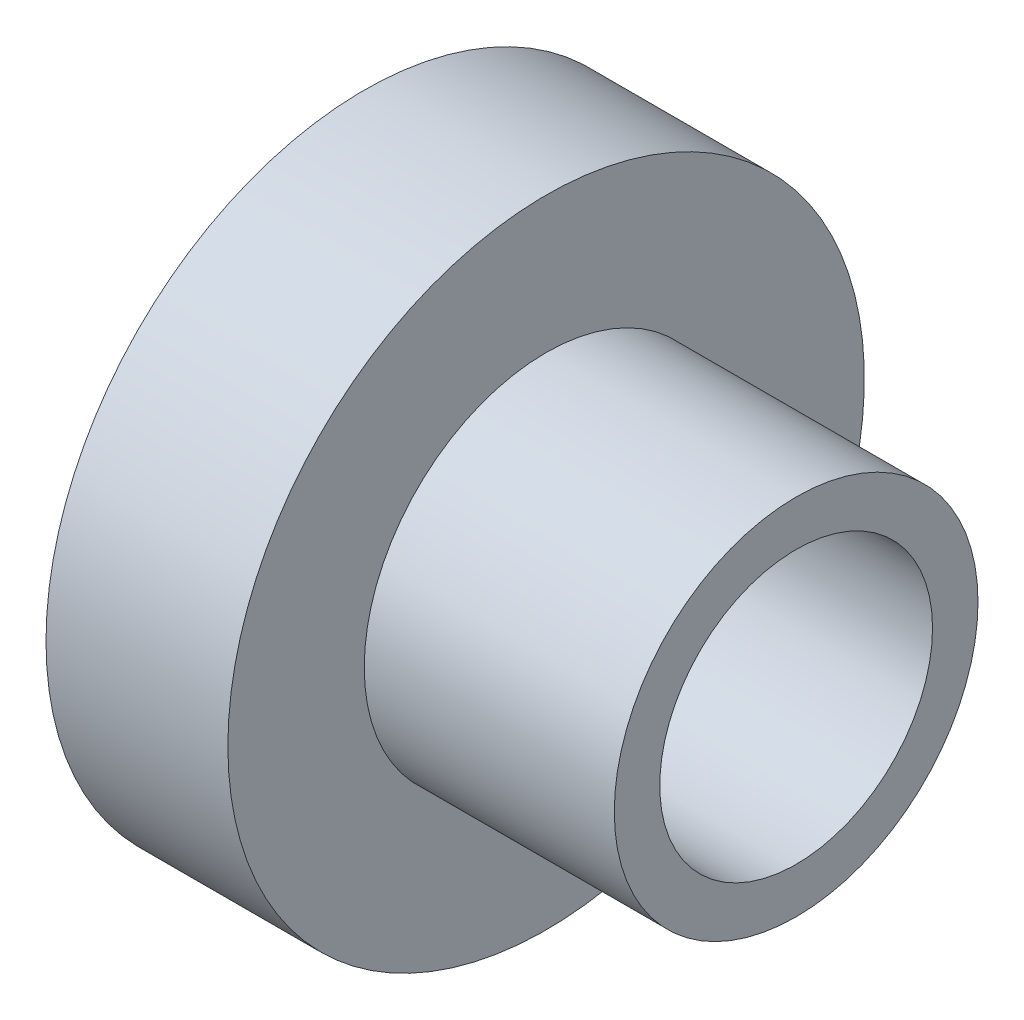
from build123d import *

# Parameters (mm, degrees)
SKETCH2_R          = 3
CUT_EXTRUDE1_DEPTH = 14.720422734


with BuildPart() as part:
    # Sketch1 → Revolve1 (revolve)
    with BuildSketch(Plane(origin=(0, 0, 0), x_dir=(1, 0, 0), z_dir=(0, 1, 0)), mode=Mode.PRIVATE) as revolve1_sk:
        Polygon((0, 0), (9.5, 0), (9.5, 4), (4, 4), (4, 7), (0, 7), align=None)
    revolve(revolve1_sk.sketch.rotate(Axis((0, 0, 0), (1, 0, 0)), 180), axis=Axis((0, 0, 0), (1, 0, 0)))

    # Sketch2 → Cut-Extrude1 (cut, through all)
    with BuildSketch(Plane(origin=(9.5, 0, 0), x_dir=(0, 0, -1), z_dir=(1, 0, 0))):
        Circle(SKETCH2_R)
    extrude(amount=-CUT_EXTRUDE1_DEPTH, mode=Mode.SUBTRACT)


solid = part.part
